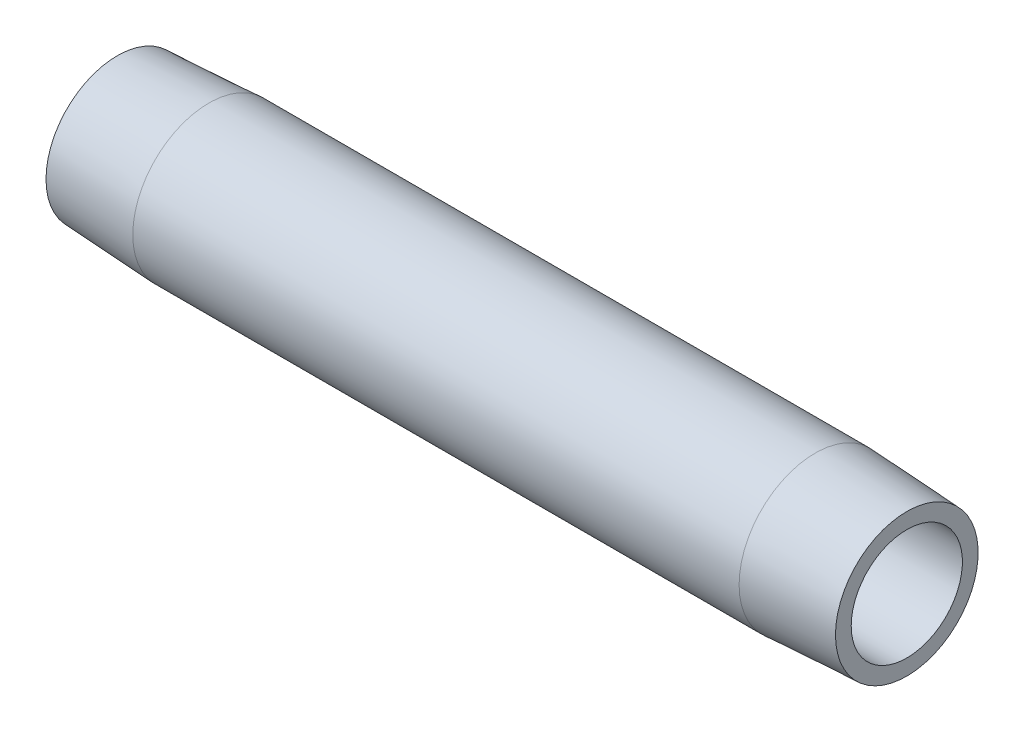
ISO-10303-21;
HEADER;
FILE_DESCRIPTION(('STEP AP214'),'2;1');
FILE_NAME('part.step','',(''),(''),'','','');
FILE_SCHEMA(('AUTOMOTIVE_DESIGN { 1 0 10303 214 1 1 1 1 }'));
ENDSEC;
DATA;
#1=APPLICATION_CONTEXT('core data for automotive mechanical design processes');
#2=APPLICATION_PROTOCOL_DEFINITION('international standard','automotive_design',2000,#1);
#3=PRODUCT_CONTEXT('',#1,'mechanical');
#4=PRODUCT('Part','Part','',(#3));
#5=PRODUCT_RELATED_PRODUCT_CATEGORY('part','',(#4));
#6=PRODUCT_DEFINITION_FORMATION('','',#4);
#7=PRODUCT_DEFINITION_CONTEXT('part definition',#1,'design');
#8=PRODUCT_DEFINITION('design','',#6,#7);
#9=PRODUCT_DEFINITION_SHAPE('','',#8);
#10=(LENGTH_UNIT() NAMED_UNIT(*) SI_UNIT(.MILLI.,.METRE.));
#11=(NAMED_UNIT(*) PLANE_ANGLE_UNIT() SI_UNIT($,.RADIAN.));
#12=(NAMED_UNIT(*) SI_UNIT($,.STERADIAN.) SOLID_ANGLE_UNIT());
#13=UNCERTAINTY_MEASURE_WITH_UNIT(LENGTH_MEASURE(1.E-05),#10,'distance_accuracy_value','');
#14=(GEOMETRIC_REPRESENTATION_CONTEXT(3) GLOBAL_UNCERTAINTY_ASSIGNED_CONTEXT((#13)) GLOBAL_UNIT_ASSIGNED_CONTEXT((#10,
#11,#12)) REPRESENTATION_CONTEXT('',''));
#15=CARTESIAN_POINT('',(0.,0.,0.));
#16=DIRECTION('',(0.,0.,1.));
#17=DIRECTION('',(1.,0.,0.));
#18=AXIS2_PLACEMENT_3D('',#15,#16,#17);
#19=CARTESIAN_POINT('',(88.9,6.26110000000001,0.));
#20=DIRECTION('',(-1.,0.,0.));
#21=DIRECTION('',(0.,0.,1.));
#22=AXIS2_PLACEMENT_3D('',#19,#20,#21);
#23=PLANE('',#22);
#24=CARTESIAN_POINT('',(88.9,0.,0.));
#25=DIRECTION('',(-1.,0.,0.));
#26=DIRECTION('',(0.,0.,1.));
#27=AXIS2_PLACEMENT_3D('',#24,#25,#26);
#28=CIRCLE('',#27,8.03205001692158);
#29=CARTESIAN_POINT('',(88.9,0.,8.03205001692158));
#30=VERTEX_POINT('',#29);
#31=EDGE_CURVE('E10',#30,#30,#28,.T.);
#32=ORIENTED_EDGE('',*,*,#31,.F.);
#33=EDGE_LOOP('',(#32));
#34=FACE_BOUND('',#33,.T.);
#35=CARTESIAN_POINT('',(88.9,0.,0.));
#36=DIRECTION('',(-1.,0.,0.));
#37=DIRECTION('',(0.,0.,1.));
#38=AXIS2_PLACEMENT_3D('',#35,#36,#37);
#39=CIRCLE('',#38,6.26110000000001);
#40=CARTESIAN_POINT('',(88.9,0.,6.26110000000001));
#41=VERTEX_POINT('',#40);
#42=EDGE_CURVE('E52',#41,#41,#39,.T.);
#43=ORIENTED_EDGE('',*,*,#42,.T.);
#44=EDGE_LOOP('',(#43));
#45=FACE_BOUND('',#44,.T.);
#46=ADVANCED_FACE('F30',(#34,#45),#23,.F.);
#47=CARTESIAN_POINT('',(88.9,0.,0.));
#48=DIRECTION('',(-1.,0.,0.));
#49=DIRECTION('',(0.,0.,1.));
#50=AXIS2_PLACEMENT_3D('',#47,#48,#49);
#51=CONICAL_SURFACE('',#50,8.03205001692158,0.0523598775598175);
#52=CARTESIAN_POINT('',(78.5876,0.,0.));
#53=DIRECTION('',(-1.,0.,0.));
#54=DIRECTION('',(0.,0.,1.));
#55=AXIS2_PLACEMENT_3D('',#52,#53,#54);
#56=CIRCLE('',#55,8.57249999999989);
#57=CARTESIAN_POINT('',(78.5876,0.,8.57249999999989));
#58=VERTEX_POINT('',#57);
#59=EDGE_CURVE('E36',#58,#58,#56,.T.);
#60=ORIENTED_EDGE('',*,*,#59,.F.);
#61=EDGE_LOOP('',(#60));
#62=FACE_BOUND('',#61,.T.);
#63=ORIENTED_EDGE('',*,*,#31,.T.);
#64=EDGE_LOOP('',(#63));
#65=FACE_BOUND('',#64,.T.);
#66=ADVANCED_FACE('F77',(#62,#65),#51,.T.);
#67=CARTESIAN_POINT('',(0.,0.,0.));
#68=DIRECTION('',(-1.,0.,0.));
#69=DIRECTION('',(0.,0.,1.));
#70=AXIS2_PLACEMENT_3D('',#67,#68,#69);
#71=CYLINDRICAL_SURFACE('',#70,8.57249999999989);
#72=CARTESIAN_POINT('',(10.3124,0.,0.));
#73=DIRECTION('',(-1.,0.,0.));
#74=DIRECTION('',(0.,0.,1.));
#75=AXIS2_PLACEMENT_3D('',#72,#73,#74);
#76=CIRCLE('',#75,8.57249999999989);
#77=CARTESIAN_POINT('',(10.3124,0.,8.57249999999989));
#78=VERTEX_POINT('',#77);
#79=EDGE_CURVE('E40',#78,#78,#76,.T.);
#80=ORIENTED_EDGE('',*,*,#79,.F.);
#81=EDGE_LOOP('',(#80));
#82=FACE_BOUND('',#81,.T.);
#83=ORIENTED_EDGE('',*,*,#59,.T.);
#84=EDGE_LOOP('',(#83));
#85=FACE_BOUND('',#84,.T.);
#86=ADVANCED_FACE('F72',(#82,#85),#71,.T.);
#87=CARTESIAN_POINT('',(10.3124,0.,0.));
#88=DIRECTION('',(1.,0.,0.));
#89=DIRECTION('',(0.,0.,-1.));
#90=AXIS2_PLACEMENT_3D('',#87,#88,#89);
#91=CONICAL_SURFACE('',#90,8.57249999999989,0.0523598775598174);
#92=CARTESIAN_POINT('',(0.,0.,0.));
#93=DIRECTION('',(-1.,0.,0.));
#94=DIRECTION('',(0.,0.,1.));
#95=AXIS2_PLACEMENT_3D('',#92,#93,#94);
#96=CIRCLE('',#95,8.03205001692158);
#97=CARTESIAN_POINT('',(0.,0.,8.03205001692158));
#98=VERTEX_POINT('',#97);
#99=EDGE_CURVE('E44',#98,#98,#96,.T.);
#100=ORIENTED_EDGE('',*,*,#99,.F.);
#101=EDGE_LOOP('',(#100));
#102=FACE_BOUND('',#101,.T.);
#103=ORIENTED_EDGE('',*,*,#79,.T.);
#104=EDGE_LOOP('',(#103));
#105=FACE_BOUND('',#104,.T.);
#106=ADVANCED_FACE('F66',(#102,#105),#91,.T.);
#107=CARTESIAN_POINT('',(0.,6.26110000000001,0.));
#108=DIRECTION('',(1.,0.,0.));
#109=DIRECTION('',(0.,0.,-1.));
#110=AXIS2_PLACEMENT_3D('',#107,#108,#109);
#111=PLANE('',#110);
#112=CARTESIAN_POINT('',(0.,0.,0.));
#113=DIRECTION('',(-1.,0.,0.));
#114=DIRECTION('',(0.,0.,1.));
#115=AXIS2_PLACEMENT_3D('',#112,#113,#114);
#116=CIRCLE('',#115,6.26110000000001);
#117=CARTESIAN_POINT('',(0.,0.,6.26110000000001));
#118=VERTEX_POINT('',#117);
#119=EDGE_CURVE('E49',#118,#118,#116,.T.);
#120=ORIENTED_EDGE('',*,*,#119,.F.);
#121=EDGE_LOOP('',(#120));
#122=FACE_BOUND('',#121,.T.);
#123=ORIENTED_EDGE('',*,*,#99,.T.);
#124=EDGE_LOOP('',(#123));
#125=FACE_BOUND('',#124,.T.);
#126=ADVANCED_FACE('F60',(#122,#125),#111,.F.);
#127=CARTESIAN_POINT('',(0.,0.,0.));
#128=DIRECTION('',(-1.,0.,0.));
#129=DIRECTION('',(0.,0.,1.));
#130=AXIS2_PLACEMENT_3D('',#127,#128,#129);
#131=CYLINDRICAL_SURFACE('',#130,6.26110000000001);
#132=ORIENTED_EDGE('',*,*,#42,.F.);
#133=EDGE_LOOP('',(#132));
#134=FACE_BOUND('',#133,.T.);
#135=ORIENTED_EDGE('',*,*,#119,.T.);
#136=EDGE_LOOP('',(#135));
#137=FACE_BOUND('',#136,.T.);
#138=ADVANCED_FACE('F57',(#134,#137),#131,.F.);
#139=CLOSED_SHELL('',(#46,#66,#86,#106,#126,#138));
#140=MANIFOLD_SOLID_BREP('B2',#139);
#141=ADVANCED_BREP_SHAPE_REPRESENTATION('',(#18,#140),#14);
#142=SHAPE_DEFINITION_REPRESENTATION(#9,#141);
ENDSEC;
END-ISO-10303-21;
